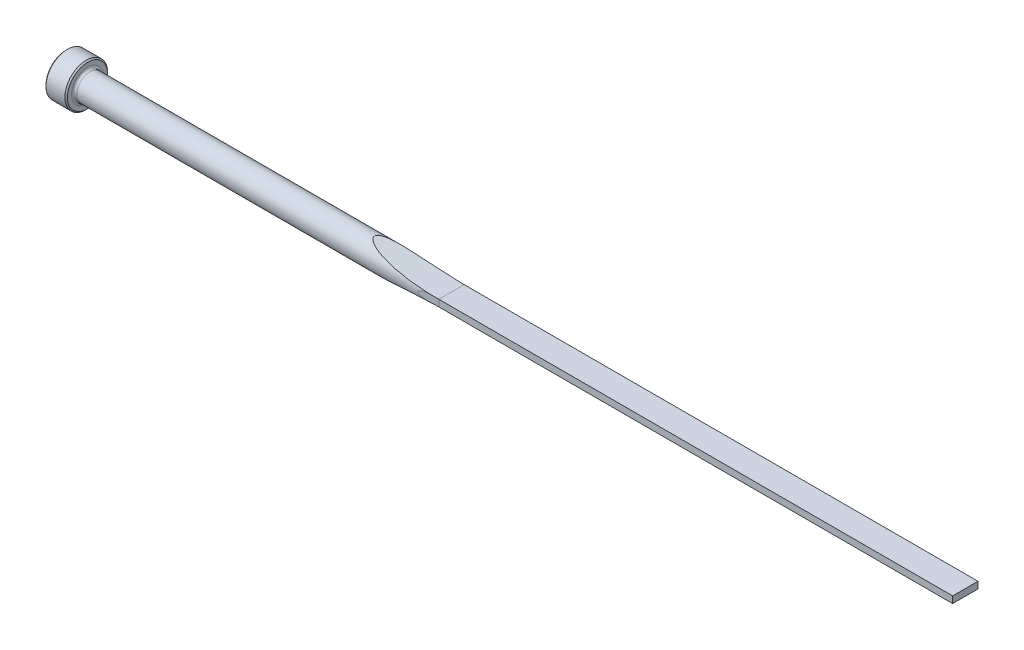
ISO-10303-21;
HEADER;
FILE_DESCRIPTION(('STEP AP214'),'2;1');
FILE_NAME('part.step','',(''),(''),'','','');
FILE_SCHEMA(('AUTOMOTIVE_DESIGN { 1 0 10303 214 1 1 1 1 }'));
ENDSEC;
DATA;
#1=APPLICATION_CONTEXT('core data for automotive mechanical design processes');
#2=APPLICATION_PROTOCOL_DEFINITION('international standard','automotive_design',2000,#1);
#3=PRODUCT_CONTEXT('',#1,'mechanical');
#4=PRODUCT('Part','Part','',(#3));
#5=PRODUCT_RELATED_PRODUCT_CATEGORY('part','',(#4));
#6=PRODUCT_DEFINITION_FORMATION('','',#4);
#7=PRODUCT_DEFINITION_CONTEXT('part definition',#1,'design');
#8=PRODUCT_DEFINITION('design','',#6,#7);
#9=PRODUCT_DEFINITION_SHAPE('','',#8);
#10=(LENGTH_UNIT() NAMED_UNIT(*) SI_UNIT(.MILLI.,.METRE.));
#11=(NAMED_UNIT(*) PLANE_ANGLE_UNIT() SI_UNIT($,.RADIAN.));
#12=(NAMED_UNIT(*) SI_UNIT($,.STERADIAN.) SOLID_ANGLE_UNIT());
#13=UNCERTAINTY_MEASURE_WITH_UNIT(LENGTH_MEASURE(1.E-05),#10,'distance_accuracy_value','');
#14=(GEOMETRIC_REPRESENTATION_CONTEXT(3) GLOBAL_UNCERTAINTY_ASSIGNED_CONTEXT((#13)) GLOBAL_UNIT_ASSIGNED_CONTEXT((#10,
#11,#12)) REPRESENTATION_CONTEXT('',''));
#15=CARTESIAN_POINT('',(0.,0.,0.));
#16=DIRECTION('',(0.,0.,1.));
#17=DIRECTION('',(1.,0.,0.));
#18=AXIS2_PLACEMENT_3D('',#15,#16,#17);
#19=CARTESIAN_POINT('',(0.,0.,0.));
#20=DIRECTION('',(-1.,0.,0.));
#21=DIRECTION('',(0.,0.,1.));
#22=AXIS2_PLACEMENT_3D('',#19,#20,#21);
#23=CYLINDRICAL_SURFACE('',#22,3.9624);
#24=CARTESIAN_POINT('',(7.112,0.,0.));
#25=DIRECTION('',(-1.,0.,0.));
#26=DIRECTION('',(0.,0.,1.));
#27=AXIS2_PLACEMENT_3D('',#24,#25,#26);
#28=CIRCLE('',#27,3.9624);
#29=CARTESIAN_POINT('',(7.112,0.,3.9624));
#30=VERTEX_POINT('',#29);
#31=EDGE_CURVE('E153',#30,#30,#28,.F.);
#32=ORIENTED_EDGE('',*,*,#31,.T.);
#33=EDGE_LOOP('',(#32));
#34=FACE_BOUND('',#33,.T.);
#35=CARTESIAN_POINT('',(114.3,1.25260892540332,3.75919999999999));
#36=CARTESIAN_POINT('',(114.00545970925,1.2524848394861,3.75919752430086));
#37=CARTESIAN_POINT('',(113.710891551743,1.24820563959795,3.76066368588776));
#38=CARTESIAN_POINT('',(113.12172376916,1.23049372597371,3.76652069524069));
#39=CARTESIAN_POINT('',(112.82712449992,1.21705045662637,3.77091491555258));
#40=CARTESIAN_POINT('',(112.230839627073,1.17967714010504,3.7827696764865));
#41=CARTESIAN_POINT('',(111.929172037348,1.15547987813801,3.79030802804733));
#42=CARTESIAN_POINT('',(111.327291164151,1.09440743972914,3.80840647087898));
#43=CARTESIAN_POINT('',(111.027077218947,1.05753871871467,3.81896502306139));
#44=CARTESIAN_POINT('',(110.580036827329,0.989457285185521,3.83693978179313));
#45=CARTESIAN_POINT('',(110.432172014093,0.964761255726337,3.84325719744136));
#46=CARTESIAN_POINT('',(110.137409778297,0.91004500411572,3.85658413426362));
#47=CARTESIAN_POINT('',(109.990512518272,0.880023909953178,3.86359376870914));
#48=CARTESIAN_POINT('',(109.69914126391,0.813153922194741,3.87821506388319));
#49=CARTESIAN_POINT('',(109.554658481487,0.776342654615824,3.88582328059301));
#50=CARTESIAN_POINT('',(109.268323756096,0.692871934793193,3.90159372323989));
#51=CARTESIAN_POINT('',(109.126472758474,0.646209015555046,3.90975614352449));
#52=CARTESIAN_POINT('',(108.918440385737,0.563595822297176,3.92220822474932));
#53=CARTESIAN_POINT('',(108.849788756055,0.533901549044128,3.92640002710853));
#54=CARTESIAN_POINT('',(108.715496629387,0.468472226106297,3.93475139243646));
#55=CARTESIAN_POINT('',(108.649847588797,0.432755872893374,3.93891101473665));
#56=CARTESIAN_POINT('',(108.560965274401,0.375177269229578,3.94463417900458));
#57=CARTESIAN_POINT('',(108.535194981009,0.357278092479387,3.94630548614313));
#58=CARTESIAN_POINT('',(108.485209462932,0.319212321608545,3.94956785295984));
#59=CARTESIAN_POINT('',(108.460999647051,0.299038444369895,3.95115862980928));
#60=CARTESIAN_POINT('',(108.414808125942,0.255565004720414,3.95421108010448));
#61=CARTESIAN_POINT('',(108.392865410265,0.23222299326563,3.9556704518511));
#62=CARTESIAN_POINT('',(108.353536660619,0.181966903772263,3.95829832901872));
#63=CARTESIAN_POINT('',(108.336121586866,0.155077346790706,3.95946868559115));
#64=CARTESIAN_POINT('',(108.315579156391,0.111677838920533,3.96085301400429));
#65=CARTESIAN_POINT('',(108.30962955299,0.0965229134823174,3.9612547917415));
#66=CARTESIAN_POINT('',(108.300234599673,0.0654488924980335,3.96188979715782));
#67=CARTESIAN_POINT('',(108.296786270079,0.0495307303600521,3.96212322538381));
#68=CARTESIAN_POINT('',(108.292762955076,0.0172237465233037,3.96239561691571));
#69=CARTESIAN_POINT('',(108.292205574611,0.00083265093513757,3.96243338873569));
#70=CARTESIAN_POINT('',(108.294083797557,-0.0317780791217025,3.9623061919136));
#71=CARTESIAN_POINT('',(108.296521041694,-0.0479976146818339,3.96214111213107));
#72=CARTESIAN_POINT('',(108.304634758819,-0.082037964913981,3.96159228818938));
#73=CARTESIAN_POINT('',(108.310722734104,-0.0997583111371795,3.96118077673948));
#74=CARTESIAN_POINT('',(108.325684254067,-0.13396962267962,3.96017177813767));
#75=CARTESIAN_POINT('',(108.334563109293,-0.15045816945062,3.959573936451));
#76=CARTESIAN_POINT('',(108.360406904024,-0.191779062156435,3.9578387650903));
#77=CARTESIAN_POINT('',(108.379002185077,-0.215572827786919,3.95659469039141));
#78=CARTESIAN_POINT('',(108.419379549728,-0.260234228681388,3.95390862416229));
#79=CARTESIAN_POINT('',(108.441170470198,-0.281093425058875,3.95246608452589));
#80=CARTESIAN_POINT('',(108.495492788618,-0.32804506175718,3.9488923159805));
#81=CARTESIAN_POINT('',(108.528933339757,-0.353067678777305,3.94670948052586));
#82=CARTESIAN_POINT('',(108.59803338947,-0.399868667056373,3.94224113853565));
#83=CARTESIAN_POINT('',(108.633697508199,-0.421639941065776,3.93995542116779));
#84=CARTESIAN_POINT('',(108.743097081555,-0.483498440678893,3.93301358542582));
#85=CARTESIAN_POINT('',(108.818906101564,-0.519877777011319,3.92829485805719));
#86=CARTESIAN_POINT('',(108.968751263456,-0.584557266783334,3.91916875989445));
#87=CARTESIAN_POINT('',(109.042649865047,-0.613195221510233,3.91475872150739));
#88=CARTESIAN_POINT('',(109.191901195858,-0.666460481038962,3.90604279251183));
#89=CARTESIAN_POINT('',(109.267254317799,-0.691086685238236,3.90173693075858));
#90=CARTESIAN_POINT('',(109.495036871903,-0.760533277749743,3.8890165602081));
#91=CARTESIAN_POINT('',(109.648854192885,-0.800789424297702,3.88081976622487));
#92=CARTESIAN_POINT('',(109.958806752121,-0.873378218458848,3.86512223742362));
#93=CARTESIAN_POINT('',(110.11494772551,-0.90568574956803,3.85762375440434));
#94=CARTESIAN_POINT('',(110.428180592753,-0.964193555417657,3.84341555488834));
#95=CARTESIAN_POINT('',(110.585270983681,-0.990401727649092,3.83670482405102));
#96=CARTESIAN_POINT('',(111.040465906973,-1.05927541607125,3.81847637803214));
#97=CARTESIAN_POINT('',(111.33953568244,-1.09580537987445,3.80800147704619));
#98=CARTESIAN_POINT('',(111.939246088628,-1.15634236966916,3.79004336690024));
#99=CARTESIAN_POINT('',(112.23988794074,-1.18033747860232,3.78256300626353));
#100=CARTESIAN_POINT('',(112.833875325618,-1.21737987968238,3.77080747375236));
#101=CARTESIAN_POINT('',(113.127202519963,-1.23070106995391,3.76645243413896));
#102=CARTESIAN_POINT('',(113.713695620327,-1.24824774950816,3.76064980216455));
#103=CARTESIAN_POINT('',(114.006861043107,-1.25248764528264,3.7591976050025));
#104=CARTESIAN_POINT('',(114.3,-1.25260892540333,3.75919999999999));
#105=B_SPLINE_CURVE_WITH_KNOTS('',3,(#35,#36,#37,#38,#39,#40,#41,#42,#43,#44,#45,#46,#47,#48,
#49,#50,#51,#52,#53,#54,#55,#56,#57,#58,#59,#60,#61,#62,#63,#64,#65,#66,#67,#68,#69,#70,#71,#72,
#73,#74,#75,#76,#77,#78,#79,#80,#81,#82,#83,#84,#85,#86,#87,#88,#89,#90,#91,#92,#93,#94,#95,#96,
#97,#98,#99,#100,#101,#102,#103,#104),.UNSPECIFIED.,.F.,.F.,(4,2,2,2,2,2,2,2,2,2,2,2,2,2,2,2,2,
2,2,2,2,2,2,2,2,2,2,2,2,2,2,2,2,2,4),(0.,0.883632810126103,1.76828515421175,2.67626818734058,
3.58378933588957,4.03386031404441,4.4840050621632,4.93172655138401,5.37960586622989,
5.60421216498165,5.82813356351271,5.92231486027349,6.01680676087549,6.11271989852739,
6.20800177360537,6.25668605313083,6.30531224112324,6.35423420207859,6.40318297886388,
6.45909548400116,6.51511503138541,6.60527273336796,6.69568462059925,6.82084462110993,
6.94627395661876,7.19837774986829,7.43639814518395,7.6744837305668,8.15173410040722,
8.63047368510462,9.10858990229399,10.0125950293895,10.9174580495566,11.7982831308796,
12.6777098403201),.UNSPECIFIED.);
#106=CARTESIAN_POINT('',(111.004990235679,1.05168448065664,3.82028448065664));
#107=VERTEX_POINT('',#106);
#108=CARTESIAN_POINT('',(111.004990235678,-1.05168448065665,3.82028448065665));
#109=VERTEX_POINT('',#108);
#110=EDGE_CURVE('E156',#107,#109,#105,.T.);
#111=ORIENTED_EDGE('',*,*,#110,.F.);
#112=CARTESIAN_POINT('',(114.3,0.990599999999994,3.83657730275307));
#113=CARTESIAN_POINT('',(113.9697161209,0.990599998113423,3.83657287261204));
#114=CARTESIAN_POINT('',(113.639435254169,0.992440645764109,3.83610266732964));
#115=CARTESIAN_POINT('',(112.978916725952,0.99980280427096,3.83419205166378));
#116=CARTESIAN_POINT('',(112.648679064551,1.0053243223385,3.83275163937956));
#117=CARTESIAN_POINT('',(111.658053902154,1.0274102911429,3.82691690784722));
#118=CARTESIAN_POINT('',(110.997788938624,1.0494961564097,3.82100908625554));
#119=CARTESIAN_POINT('',(109.676435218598,1.10844500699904,3.80432664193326));
#120=CARTESIAN_POINT('',(109.015348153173,1.14534247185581,3.79354065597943));
#121=CARTESIAN_POINT('',(107.694310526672,1.23388520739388,3.76567429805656));
#122=CARTESIAN_POINT('',(107.034359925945,1.2855299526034,3.74859415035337));
#123=CARTESIAN_POINT('',(105.715852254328,1.40353519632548,3.70602748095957));
#124=CARTESIAN_POINT('',(105.057295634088,1.46989988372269,3.68053856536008));
#125=CARTESIAN_POINT('',(103.742255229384,1.61726452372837,3.6182196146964));
#126=CARTESIAN_POINT('',(103.08577166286,1.69826596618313,3.58138842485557));
#127=CARTESIAN_POINT('',(102.103558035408,1.83058710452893,3.51453728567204));
#128=CARTESIAN_POINT('',(101.776691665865,1.87647848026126,3.49033052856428));
#129=CARTESIAN_POINT('',(101.123854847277,1.97184201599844,3.43735915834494));
#130=CARTESIAN_POINT('',(100.797884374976,2.02131408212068,3.40859466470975));
#131=CARTESIAN_POINT('',(100.147081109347,2.12378750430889,3.34570677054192));
#132=CARTESIAN_POINT('',(99.8222480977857,2.17678813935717,3.3115844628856));
#133=CARTESIAN_POINT('',(99.1739107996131,2.28626507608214,3.23697347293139));
#134=CARTESIAN_POINT('',(98.8504064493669,2.34274120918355,3.19648509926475));
#135=CARTESIAN_POINT('',(98.2047395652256,2.45913947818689,3.10783063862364));
#136=CARTESIAN_POINT('',(97.8825785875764,2.51906481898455,3.05965733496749));
#137=CARTESIAN_POINT('',(97.2403530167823,2.64218817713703,2.95398736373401));
#138=CARTESIAN_POINT('',(96.9202887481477,2.70538668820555,2.8964892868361));
#139=CARTESIAN_POINT('',(96.2828388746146,2.83488406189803,2.7698900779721));
#140=CARTESIAN_POINT('',(95.9654549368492,2.90118470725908,2.7007822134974));
#141=CARTESIAN_POINT('',(95.492569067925,3.00264596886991,2.58598405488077));
#142=CARTESIAN_POINT('',(95.3354929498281,3.03679672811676,2.54586806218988));
#143=CARTESIAN_POINT('',(95.0226368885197,3.10569973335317,2.46134595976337));
#144=CARTESIAN_POINT('',(94.866856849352,3.14045193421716,2.41694017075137));
#145=CARTESIAN_POINT('',(94.5564212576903,3.21057634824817,2.32298544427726));
#146=CARTESIAN_POINT('',(94.4017708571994,3.24595018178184,2.27342059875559));
#147=CARTESIAN_POINT('',(94.0945437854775,3.31707981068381,2.16832369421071));
#148=CARTESIAN_POINT('',(93.9419675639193,3.35283568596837,2.11279036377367));
#149=CARTESIAN_POINT('',(93.6400973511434,3.4244077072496,1.99469390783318));
#150=CARTESIAN_POINT('',(93.4907949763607,3.46022336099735,1.93215209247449));
#151=CARTESIAN_POINT('',(93.1962051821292,3.53168170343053,1.79822571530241));
#152=CARTESIAN_POINT('',(93.050915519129,3.56732447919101,1.7268462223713));
#153=CARTESIAN_POINT('',(92.7936363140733,3.63110569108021,1.58756568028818));
#154=CARTESIAN_POINT('',(92.6806184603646,3.65936845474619,1.52163804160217));
#155=CARTESIAN_POINT('',(92.4598827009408,3.71501044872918,1.38025632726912));
#156=CARTESIAN_POINT('',(92.3521804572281,3.74238699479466,1.30477619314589));
#157=CARTESIAN_POINT('',(92.1442872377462,3.79561737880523,1.1408213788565));
#158=CARTESIAN_POINT('',(92.0442076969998,3.82144775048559,1.05219528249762));
#159=CARTESIAN_POINT('',(91.8595768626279,3.86940293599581,0.859157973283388));
#160=CARTESIAN_POINT('',(91.7749415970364,3.89154772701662,0.754838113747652));
#161=CARTESIAN_POINT('',(91.6699193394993,3.91914686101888,0.586474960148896));
#162=CARTESIAN_POINT('',(91.6389545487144,3.92730670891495,0.529540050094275));
#163=CARTESIAN_POINT('',(91.585487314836,3.94141927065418,0.411526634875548));
#164=CARTESIAN_POINT('',(91.5629775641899,3.94737389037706,0.350451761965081));
#165=CARTESIAN_POINT('',(91.5283368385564,3.95654565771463,0.224449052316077));
#166=CARTESIAN_POINT('',(91.516316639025,3.95973358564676,0.159487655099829));
#167=CARTESIAN_POINT('',(91.5046069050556,3.96283907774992,0.0283885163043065));
#168=CARTESIAN_POINT('',(91.5049079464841,3.96275914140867,-0.0377482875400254));
#169=CARTESIAN_POINT('',(91.5170523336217,3.9595385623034,-0.161504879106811));
#170=CARTESIAN_POINT('',(91.5276298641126,3.95673358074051,-0.219265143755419));
#171=CARTESIAN_POINT('',(91.557415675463,3.94884592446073,-0.332339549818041));
#172=CARTESIAN_POINT('',(91.5766306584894,3.94376148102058,-0.387651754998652));
#173=CARTESIAN_POINT('',(91.6328391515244,3.92891668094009,-0.520111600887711));
#174=CARTESIAN_POINT('',(91.6739445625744,3.91808157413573,-0.595377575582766));
#175=CARTESIAN_POINT('',(91.7669212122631,3.89366591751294,-0.738435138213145));
#176=CARTESIAN_POINT('',(91.8188218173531,3.88007788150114,-0.806205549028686));
#177=CARTESIAN_POINT('',(91.9247534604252,3.85246275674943,-0.928819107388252));
#178=CARTESIAN_POINT('',(91.9781271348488,3.83859662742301,-0.984278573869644));
#179=CARTESIAN_POINT('',(92.0893027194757,3.80983427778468,-1.09032012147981));
#180=CARTESIAN_POINT('',(92.1471085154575,3.79493715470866,-1.14089783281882));
#181=CARTESIAN_POINT('',(92.266095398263,3.76440868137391,-1.23791396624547));
#182=CARTESIAN_POINT('',(92.3272835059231,3.74877581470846,-1.28434321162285));
#183=CARTESIAN_POINT('',(92.4521157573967,3.71703035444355,-1.37351180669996));
#184=CARTESIAN_POINT('',(92.5157589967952,3.70091793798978,-1.41625249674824));
#185=CARTESIAN_POINT('',(92.6792221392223,3.65973348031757,-1.52038239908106));
#186=CARTESIAN_POINT('',(92.7803365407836,3.63443926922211,-1.57964797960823));
#187=CARTESIAN_POINT('',(92.9857900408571,3.58344108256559,-1.69214942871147));
#188=CARTESIAN_POINT('',(93.0901308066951,3.55773689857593,-1.74538211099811));
#189=CARTESIAN_POINT('',(93.3013643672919,3.50611562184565,-1.84689329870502));
#190=CARTESIAN_POINT('',(93.4082612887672,3.48019823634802,-1.89516301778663));
#191=CARTESIAN_POINT('',(93.6238923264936,3.42834878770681,-1.98741770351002));
#192=CARTESIAN_POINT('',(93.7326267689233,3.40241672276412,-2.03140189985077));
#193=CARTESIAN_POINT('',(94.0621134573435,3.32450390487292,-2.15829335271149));
#194=CARTESIAN_POINT('',(94.2850557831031,3.27267410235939,-2.23563168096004));
#195=CARTESIAN_POINT('',(94.6221345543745,3.19570441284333,-2.34307368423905));
#196=CARTESIAN_POINT('',(94.7348766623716,3.1701906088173,-2.37744382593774));
#197=CARTESIAN_POINT('',(94.9611693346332,3.11944659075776,-2.44364722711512));
#198=CARTESIAN_POINT('',(95.0747198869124,3.09421637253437,-2.47548052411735));
#199=CARTESIAN_POINT('',(95.4104539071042,3.02031374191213,-2.56598748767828));
#200=CARTESIAN_POINT('',(95.6335886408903,2.97208906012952,-2.62150201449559));
#201=CARTESIAN_POINT('',(96.0818053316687,2.87703845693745,-2.72547491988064));
#202=CARTESIAN_POINT('',(96.3068875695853,2.83021274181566,-2.77393226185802));
#203=CARTESIAN_POINT('',(96.7586626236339,2.73806329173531,-2.86492906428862));
#204=CARTESIAN_POINT('',(96.9853561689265,2.69274029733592,-2.90746563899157));
#205=CARTESIAN_POINT('',(97.4399562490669,2.60370183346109,-2.9874606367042));
#206=CARTESIAN_POINT('',(97.6678628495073,2.55998645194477,-3.02491878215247));
#207=CARTESIAN_POINT('',(98.3540991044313,2.43115134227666,-3.13090570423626));
#208=CARTESIAN_POINT('',(98.8139246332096,2.34855100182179,-3.19284857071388));
#209=CARTESIAN_POINT('',(99.7362107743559,2.19040055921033,-3.30333290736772));
#210=CARTESIAN_POINT('',(100.198670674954,2.11484864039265,-3.35187783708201));
#211=CARTESIAN_POINT('',(101.126223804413,1.97085164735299,-3.43852039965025));
#212=CARTESIAN_POINT('',(101.591319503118,1.90241509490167,-3.47660559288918));
#213=CARTESIAN_POINT('',(102.523152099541,1.77285400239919,-3.54442368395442));
#214=CARTESIAN_POINT('',(102.989889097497,1.71172991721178,-3.57415606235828));
#215=CARTESIAN_POINT('',(103.924078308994,1.59693400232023,-3.62689928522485));
#216=CARTESIAN_POINT('',(104.391528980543,1.54325327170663,-3.64991819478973));
#217=CARTESIAN_POINT('',(105.3274350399,1.44330178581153,-3.69058205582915));
#218=CARTESIAN_POINT('',(105.79589039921,1.39703082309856,-3.70822715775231));
#219=CARTESIAN_POINT('',(106.934572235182,1.29368812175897,-3.74582413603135));
#220=CARTESIAN_POINT('',(107.605227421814,1.24048648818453,-3.76352357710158));
#221=CARTESIAN_POINT('',(108.947882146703,1.14930326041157,-3.79235889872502));
#222=CARTESIAN_POINT('',(109.619882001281,1.1113258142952,-3.80349299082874));
#223=CARTESIAN_POINT('',(110.959832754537,1.05085761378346,-3.82064091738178));
#224=CARTESIAN_POINT('',(111.627778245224,1.02825806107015,-3.82669079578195));
#225=CARTESIAN_POINT('',(112.629852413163,1.00566200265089,-3.83266331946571));
#226=CARTESIAN_POINT('',(112.963854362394,1.00001386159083,-3.83413712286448));
#227=CARTESIAN_POINT('',(113.631903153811,0.992482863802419,-3.83609180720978));
#228=CARTESIAN_POINT('',(113.965949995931,0.990600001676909,-3.83657268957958));
#229=CARTESIAN_POINT('',(114.3,0.990599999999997,-3.83657730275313));
#230=B_SPLINE_CURVE_WITH_KNOTS('',3,(#112,#113,#114,#115,#116,#117,#118,#119,#120,#121,#122,
#123,#124,#125,#126,#127,#128,#129,#130,#131,#132,#133,#134,#135,#136,#137,#138,#139,#140,#141,
#142,#143,#144,#145,#146,#147,#148,#149,#150,#151,#152,#153,#154,#155,#156,#157,#158,#159,#160,
#161,#162,#163,#164,#165,#166,#167,#168,#169,#170,#171,#172,#173,#174,#175,#176,#177,#178,#179,
#180,#181,#182,#183,#184,#185,#186,#187,#188,#189,#190,#191,#192,#193,#194,#195,#196,#197,#198,
#199,#200,#201,#202,#203,#204,#205,#206,#207,#208,#209,#210,#211,#212,#213,#214,#215,#216,#217,
#218,#219,#220,#221,#222,#223,#224,#225,#226,#227,#228,#229),.UNSPECIFIED.,.F.,.F.,(4,2,2,2,2,2,
2,2,2,2,2,2,2,2,2,2,2,2,2,2,2,2,2,2,2,2,2,2,2,2,2,2,2,2,2,2,2,2,2,2,2,2,2,2,2,2,2,2,2,2,2,2,2,2,
2,2,2,2,4),(0.,0.990840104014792,1.98168214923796,3.9634703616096,5.94989893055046,
7.93625672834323,9.92318051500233,11.9103066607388,12.9031409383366,13.8959491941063,
14.8885552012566,15.8811131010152,16.8746086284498,17.8682544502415,18.86247848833,
19.3594573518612,19.8563990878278,20.3549212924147,20.853549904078,21.3507015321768,
21.8475693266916,22.2488324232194,22.6512147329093,23.0586550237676,23.4638093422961,
23.6592125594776,23.8544465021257,24.0517181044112,24.2488388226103,24.4244032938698,
24.6001042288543,24.8579506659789,25.1165079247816,25.3507932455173,25.5852863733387,
25.8202859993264,26.0551998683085,26.4146312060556,26.7742515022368,27.1344978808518,
27.4948088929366,28.2191273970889,28.5808955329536,28.9426583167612,29.6473193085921,
30.3520836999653,31.0571903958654,31.7623356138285,33.175804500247,34.5889080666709,
36.0036850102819,37.418549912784,38.8317080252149,40.2448265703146,42.2635801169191,
44.282883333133,46.287747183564,47.2898866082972,48.2920245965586),.UNSPECIFIED.);
#231=CARTESIAN_POINT('',(111.004990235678,1.05168448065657,-3.82028448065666));
#232=VERTEX_POINT('',#231);
#233=EDGE_CURVE('E106',#107,#232,#230,.T.);
#234=ORIENTED_EDGE('',*,*,#233,.T.);
#235=CARTESIAN_POINT('',(114.3,1.25260892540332,-3.75919999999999));
#236=CARTESIAN_POINT('',(114.00545970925,1.2524848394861,-3.75919752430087));
#237=CARTESIAN_POINT('',(113.710891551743,1.24820563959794,-3.76066368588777));
#238=CARTESIAN_POINT('',(113.12172376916,1.23049372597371,-3.76652069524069));
#239=CARTESIAN_POINT('',(112.827124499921,1.21705045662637,-3.77091491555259));
#240=CARTESIAN_POINT('',(112.230839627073,1.17967714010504,-3.78276967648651));
#241=CARTESIAN_POINT('',(111.929172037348,1.15547987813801,-3.79030802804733));
#242=CARTESIAN_POINT('',(111.327291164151,1.09440743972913,-3.80840647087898));
#243=CARTESIAN_POINT('',(111.027077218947,1.05753871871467,-3.81896502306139));
#244=CARTESIAN_POINT('',(110.580036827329,0.98945728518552,-3.83693978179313));
#245=CARTESIAN_POINT('',(110.432172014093,0.964761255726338,-3.84325719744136));
#246=CARTESIAN_POINT('',(110.137409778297,0.910045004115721,-3.85658413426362));
#247=CARTESIAN_POINT('',(109.990512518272,0.880023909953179,-3.86359376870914));
#248=CARTESIAN_POINT('',(109.69914126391,0.813153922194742,-3.87821506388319));
#249=CARTESIAN_POINT('',(109.554658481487,0.776342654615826,-3.88582328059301));
#250=CARTESIAN_POINT('',(109.268323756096,0.692871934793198,-3.90159372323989));
#251=CARTESIAN_POINT('',(109.126472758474,0.646209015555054,-3.90975614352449));
#252=CARTESIAN_POINT('',(108.918440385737,0.56359582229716,-3.92220822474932));
#253=CARTESIAN_POINT('',(108.849788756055,0.533901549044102,-3.92640002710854));
#254=CARTESIAN_POINT('',(108.715496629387,0.468472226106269,-3.93475139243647));
#255=CARTESIAN_POINT('',(108.649847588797,0.432755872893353,-3.93891101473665));
#256=CARTESIAN_POINT('',(108.560965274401,0.37517726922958,-3.94463417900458));
#257=CARTESIAN_POINT('',(108.535194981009,0.357278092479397,-3.94630548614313));
#258=CARTESIAN_POINT('',(108.485209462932,0.319212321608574,-3.94956785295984));
#259=CARTESIAN_POINT('',(108.460999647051,0.299038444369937,-3.95115862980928));
#260=CARTESIAN_POINT('',(108.414808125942,0.25556500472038,-3.95421108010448));
#261=CARTESIAN_POINT('',(108.392865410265,0.232222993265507,-3.95567045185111));
#262=CARTESIAN_POINT('',(108.353536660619,0.181966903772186,-3.95829832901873));
#263=CARTESIAN_POINT('',(108.336121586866,0.15507734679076,-3.95946868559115));
#264=CARTESIAN_POINT('',(108.315579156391,0.111677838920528,-3.96085301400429));
#265=CARTESIAN_POINT('',(108.30962955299,0.0965229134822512,-3.9612547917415));
#266=CARTESIAN_POINT('',(108.300234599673,0.0654488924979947,-3.96188979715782));
#267=CARTESIAN_POINT('',(108.296786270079,0.0495307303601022,-3.96212322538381));
#268=CARTESIAN_POINT('',(108.292762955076,0.0172237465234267,-3.9623956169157));
#269=CARTESIAN_POINT('',(108.292205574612,0.000832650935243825,-3.96243338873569));
#270=CARTESIAN_POINT('',(108.294083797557,-0.0317780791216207,-3.9623061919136));
#271=CARTESIAN_POINT('',(108.296521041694,-0.0479976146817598,-3.96214111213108));
#272=CARTESIAN_POINT('',(108.304634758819,-0.0820379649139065,-3.96159228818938));
#273=CARTESIAN_POINT('',(108.310722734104,-0.0997583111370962,-3.96118077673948));
#274=CARTESIAN_POINT('',(108.325684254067,-0.133969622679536,-3.96017177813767));
#275=CARTESIAN_POINT('',(108.334563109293,-0.150458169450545,-3.959573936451));
#276=CARTESIAN_POINT('',(108.360406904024,-0.191779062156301,-3.9578387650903));
#277=CARTESIAN_POINT('',(108.379002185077,-0.215572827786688,-3.95659469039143));
#278=CARTESIAN_POINT('',(108.419379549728,-0.260234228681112,-3.9539086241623));
#279=CARTESIAN_POINT('',(108.441170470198,-0.281093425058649,-3.9524660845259));
#280=CARTESIAN_POINT('',(108.495492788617,-0.328045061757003,-3.94889231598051));
#281=CARTESIAN_POINT('',(108.528933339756,-0.353067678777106,-3.94670948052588));
#282=CARTESIAN_POINT('',(108.59803338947,-0.399868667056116,-3.94224113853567));
#283=CARTESIAN_POINT('',(108.633697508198,-0.421639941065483,-3.93995542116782));
#284=CARTESIAN_POINT('',(108.743097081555,-0.483498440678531,-3.93301358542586));
#285=CARTESIAN_POINT('',(108.818906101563,-0.519877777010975,-3.92829485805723));
#286=CARTESIAN_POINT('',(108.968751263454,-0.584557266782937,-3.91916875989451));
#287=CARTESIAN_POINT('',(109.042649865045,-0.613195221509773,-3.91475872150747));
#288=CARTESIAN_POINT('',(109.191901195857,-0.666460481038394,-3.90604279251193));
#289=CARTESIAN_POINT('',(109.267254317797,-0.691086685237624,-3.90173693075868));
#290=CARTESIAN_POINT('',(109.495036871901,-0.760533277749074,-3.88901656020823));
#291=CARTESIAN_POINT('',(109.648854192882,-0.800789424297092,-3.88081976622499));
#292=CARTESIAN_POINT('',(109.958806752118,-0.873378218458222,-3.86512223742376));
#293=CARTESIAN_POINT('',(110.114947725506,-0.905685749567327,-3.8576237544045));
#294=CARTESIAN_POINT('',(110.42818059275,-0.964193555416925,-3.84341555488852));
#295=CARTESIAN_POINT('',(110.585270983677,-0.990401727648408,-3.8367048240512));
#296=CARTESIAN_POINT('',(111.040465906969,-1.05927541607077,-3.81847637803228));
#297=CARTESIAN_POINT('',(111.339535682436,-1.09580537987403,-3.80800147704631));
#298=CARTESIAN_POINT('',(111.939246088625,-1.1563423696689,-3.79004336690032));
#299=CARTESIAN_POINT('',(112.239887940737,-1.18033747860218,-3.78256300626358));
#300=CARTESIAN_POINT('',(112.833875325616,-1.21737987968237,-3.77080747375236));
#301=CARTESIAN_POINT('',(113.127202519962,-1.23070106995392,-3.76645243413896));
#302=CARTESIAN_POINT('',(113.713695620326,-1.24824774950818,-3.76064980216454));
#303=CARTESIAN_POINT('',(114.006861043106,-1.25248764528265,-3.7591976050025));
#304=CARTESIAN_POINT('',(114.3,-1.25260892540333,-3.75919999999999));
#305=B_SPLINE_CURVE_WITH_KNOTS('',3,(#235,#236,#237,#238,#239,#240,#241,#242,#243,#244,#245,
#246,#247,#248,#249,#250,#251,#252,#253,#254,#255,#256,#257,#258,#259,#260,#261,#262,#263,#264,
#265,#266,#267,#268,#269,#270,#271,#272,#273,#274,#275,#276,#277,#278,#279,#280,#281,#282,#283,
#284,#285,#286,#287,#288,#289,#290,#291,#292,#293,#294,#295,#296,#297,#298,#299,#300,#301,#302,
#303,#304),.UNSPECIFIED.,.F.,.F.,(4,2,2,2,2,2,2,2,2,2,2,2,2,2,2,2,2,2,2,2,2,2,2,2,2,2,2,2,2,2,2,
2,2,2,4),(0.,0.883632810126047,1.76828515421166,2.67626818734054,3.58378933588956,
4.03386031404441,4.48400506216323,4.93172655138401,5.37960586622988,5.60421216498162,
5.82813356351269,5.92231486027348,6.01680676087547,6.11271989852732,6.20800177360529,
6.25668605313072,6.30531224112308,6.35423420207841,6.40318297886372,6.459095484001,
6.51511503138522,6.60527273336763,6.69568462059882,6.82084462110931,6.94627395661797,
7.1983777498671,7.4363981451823,7.6744837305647,8.15173410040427,8.63047368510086,
9.10858990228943,10.0125950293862,10.9174580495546,11.7982831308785,12.67770984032),.UNSPECIFIED.);
#306=CARTESIAN_POINT('',(111.004990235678,-1.05168448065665,-3.82028448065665));
#307=VERTEX_POINT('',#306);
#308=EDGE_CURVE('E175',#232,#307,#305,.T.);
#309=ORIENTED_EDGE('',*,*,#308,.T.);
#310=CARTESIAN_POINT('',(114.3,-0.990599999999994,3.83657730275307));
#311=CARTESIAN_POINT('',(113.9697161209,-0.990599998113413,3.83657287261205));
#312=CARTESIAN_POINT('',(113.639435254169,-0.992440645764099,3.83610266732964));
#313=CARTESIAN_POINT('',(112.978916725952,-0.999802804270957,3.83419205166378));
#314=CARTESIAN_POINT('',(112.648679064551,-1.0053243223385,3.83275163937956));
#315=CARTESIAN_POINT('',(111.658053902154,-1.0274102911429,3.82691690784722));
#316=CARTESIAN_POINT('',(110.997788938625,-1.0494961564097,3.82100908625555));
#317=CARTESIAN_POINT('',(109.676435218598,-1.10844500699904,3.80432664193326));
#318=CARTESIAN_POINT('',(109.015348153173,-1.14534247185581,3.79354065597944));
#319=CARTESIAN_POINT('',(107.694310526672,-1.23388520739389,3.76567429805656));
#320=CARTESIAN_POINT('',(107.034359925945,-1.28552995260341,3.74859415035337));
#321=CARTESIAN_POINT('',(105.715852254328,-1.40353519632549,3.70602748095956));
#322=CARTESIAN_POINT('',(105.057295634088,-1.4698998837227,3.68053856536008));
#323=CARTESIAN_POINT('',(103.742255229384,-1.61726452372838,3.6182196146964));
#324=CARTESIAN_POINT('',(103.08577166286,-1.69826596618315,3.58138842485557));
#325=CARTESIAN_POINT('',(102.103558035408,-1.83058710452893,3.51453728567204));
#326=CARTESIAN_POINT('',(101.776691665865,-1.87647848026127,3.49033052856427));
#327=CARTESIAN_POINT('',(101.123854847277,-1.97184201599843,3.43735915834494));
#328=CARTESIAN_POINT('',(100.797884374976,-2.02131408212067,3.40859466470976));
#329=CARTESIAN_POINT('',(100.147081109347,-2.12378750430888,3.34570677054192));
#330=CARTESIAN_POINT('',(99.8222480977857,-2.17678813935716,3.3115844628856));
#331=CARTESIAN_POINT('',(99.1739107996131,-2.28626507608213,3.23697347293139));
#332=CARTESIAN_POINT('',(98.8504064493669,-2.34274120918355,3.19648509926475));
#333=CARTESIAN_POINT('',(98.2047395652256,-2.45913947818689,3.10783063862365));
#334=CARTESIAN_POINT('',(97.8825785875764,-2.51906481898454,3.05965733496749));
#335=CARTESIAN_POINT('',(97.2403530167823,-2.64218817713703,2.95398736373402));
#336=CARTESIAN_POINT('',(96.9202887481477,-2.70538668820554,2.89648928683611));
#337=CARTESIAN_POINT('',(96.2828388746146,-2.83488406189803,2.7698900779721));
#338=CARTESIAN_POINT('',(95.9654549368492,-2.90118470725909,2.7007822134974));
#339=CARTESIAN_POINT('',(95.492569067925,-3.0026459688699,2.58598405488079));
#340=CARTESIAN_POINT('',(95.3354929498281,-3.03679672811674,2.54586806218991));
#341=CARTESIAN_POINT('',(95.0226368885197,-3.10569973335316,2.46134595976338));
#342=CARTESIAN_POINT('',(94.866856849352,-3.14045193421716,2.41694017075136));
#343=CARTESIAN_POINT('',(94.5564212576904,-3.21057634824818,2.32298544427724));
#344=CARTESIAN_POINT('',(94.4017708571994,-3.24595018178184,2.27342059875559));
#345=CARTESIAN_POINT('',(94.0945437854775,-3.3170798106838,2.16832369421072));
#346=CARTESIAN_POINT('',(93.9419675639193,-3.35283568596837,2.11279036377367));
#347=CARTESIAN_POINT('',(93.6400973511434,-3.4244077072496,1.99469390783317));
#348=CARTESIAN_POINT('',(93.4907949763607,-3.46022336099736,1.93215209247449));
#349=CARTESIAN_POINT('',(93.1962051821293,-3.53168170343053,1.79822571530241));
#350=CARTESIAN_POINT('',(93.050915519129,-3.56732447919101,1.7268462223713));
#351=CARTESIAN_POINT('',(92.7936363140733,-3.6311056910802,1.58756568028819));
#352=CARTESIAN_POINT('',(92.6806184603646,-3.65936845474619,1.52163804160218));
#353=CARTESIAN_POINT('',(92.4598827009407,-3.71501044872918,1.38025632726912));
#354=CARTESIAN_POINT('',(92.3521804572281,-3.74238699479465,1.30477619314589));
#355=CARTESIAN_POINT('',(92.1442872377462,-3.79561737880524,1.1408213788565));
#356=CARTESIAN_POINT('',(92.0442076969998,-3.82144775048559,1.05219528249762));
#357=CARTESIAN_POINT('',(91.8595768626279,-3.86940293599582,0.859157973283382));
#358=CARTESIAN_POINT('',(91.7749415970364,-3.89154772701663,0.754838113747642));
#359=CARTESIAN_POINT('',(91.6699193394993,-3.91914686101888,0.586474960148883));
#360=CARTESIAN_POINT('',(91.6389545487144,-3.92730670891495,0.529540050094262));
#361=CARTESIAN_POINT('',(91.585487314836,-3.94141927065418,0.411526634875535));
#362=CARTESIAN_POINT('',(91.5629775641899,-3.94737389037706,0.350451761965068));
#363=CARTESIAN_POINT('',(91.5283368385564,-3.95654565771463,0.224449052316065));
#364=CARTESIAN_POINT('',(91.516316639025,-3.95973358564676,0.159487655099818));
#365=CARTESIAN_POINT('',(91.5046069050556,-3.96283907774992,0.0283885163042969));
#366=CARTESIAN_POINT('',(91.5049079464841,-3.96275914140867,-0.0377482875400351));
#367=CARTESIAN_POINT('',(91.5170523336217,-3.9595385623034,-0.16150487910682));
#368=CARTESIAN_POINT('',(91.5276298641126,-3.95673358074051,-0.219265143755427));
#369=CARTESIAN_POINT('',(91.557415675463,-3.94884592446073,-0.33233954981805));
#370=CARTESIAN_POINT('',(91.5766306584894,-3.94376148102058,-0.387651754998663));
#371=CARTESIAN_POINT('',(91.6328391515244,-3.92891668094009,-0.520111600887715));
#372=CARTESIAN_POINT('',(91.6739445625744,-3.91808157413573,-0.595377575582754));
#373=CARTESIAN_POINT('',(91.7669212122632,-3.89366591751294,-0.73843513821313));
#374=CARTESIAN_POINT('',(91.8188218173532,-3.88007788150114,-0.806205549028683));
#375=CARTESIAN_POINT('',(91.9247534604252,-3.85246275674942,-0.928819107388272));
#376=CARTESIAN_POINT('',(91.9781271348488,-3.838596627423,-0.984278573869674));
#377=CARTESIAN_POINT('',(92.0893027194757,-3.80983427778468,-1.09032012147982));
#378=CARTESIAN_POINT('',(92.1471085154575,-3.79493715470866,-1.14089783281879));
#379=CARTESIAN_POINT('',(92.266095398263,-3.76440868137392,-1.23791396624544));
#380=CARTESIAN_POINT('',(92.3272835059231,-3.74877581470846,-1.28434321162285));
#381=CARTESIAN_POINT('',(92.4521157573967,-3.71703035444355,-1.37351180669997));
#382=CARTESIAN_POINT('',(92.5157589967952,-3.70091793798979,-1.41625249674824));
#383=CARTESIAN_POINT('',(92.6792221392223,-3.65973348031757,-1.52038239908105));
#384=CARTESIAN_POINT('',(92.7803365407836,-3.6344392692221,-1.57964797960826));
#385=CARTESIAN_POINT('',(92.9857900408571,-3.58344108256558,-1.6921494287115));
#386=CARTESIAN_POINT('',(93.0901308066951,-3.55773689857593,-1.74538211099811));
#387=CARTESIAN_POINT('',(93.3013643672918,-3.50611562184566,-1.84689329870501));
#388=CARTESIAN_POINT('',(93.4082612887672,-3.48019823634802,-1.89516301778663));
#389=CARTESIAN_POINT('',(93.6238923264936,-3.4283487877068,-1.98741770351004));
#390=CARTESIAN_POINT('',(93.7326267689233,-3.40241672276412,-2.03140189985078));
#391=CARTESIAN_POINT('',(94.0621134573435,-3.32450390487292,-2.15829335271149));
#392=CARTESIAN_POINT('',(94.285055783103,-3.27267410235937,-2.23563168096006));
#393=CARTESIAN_POINT('',(94.6221345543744,-3.19570441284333,-2.34307368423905));
#394=CARTESIAN_POINT('',(94.7348766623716,-3.17019060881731,-2.37744382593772));
#395=CARTESIAN_POINT('',(94.9611693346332,-3.11944659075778,-2.4436472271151));
#396=CARTESIAN_POINT('',(95.0747198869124,-3.09421637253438,-2.47548052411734));
#397=CARTESIAN_POINT('',(95.4104539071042,-3.02031374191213,-2.56598748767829));
#398=CARTESIAN_POINT('',(95.6335886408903,-2.97208906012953,-2.62150201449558));
#399=CARTESIAN_POINT('',(96.0818053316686,-2.87703845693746,-2.72547491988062));
#400=CARTESIAN_POINT('',(96.3068875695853,-2.83021274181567,-2.77393226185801));
#401=CARTESIAN_POINT('',(96.7586626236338,-2.73806329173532,-2.86492906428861));
#402=CARTESIAN_POINT('',(96.9853561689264,-2.69274029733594,-2.90746563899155));
#403=CARTESIAN_POINT('',(97.4399562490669,-2.60370183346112,-2.98746063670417));
#404=CARTESIAN_POINT('',(97.6678628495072,-2.55998645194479,-3.02491878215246));
#405=CARTESIAN_POINT('',(98.3540991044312,-2.43115134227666,-3.13090570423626));
#406=CARTESIAN_POINT('',(98.8139246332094,-2.34855100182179,-3.19284857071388));
#407=CARTESIAN_POINT('',(99.7362107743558,-2.19040055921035,-3.30333290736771));
#408=CARTESIAN_POINT('',(100.198670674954,-2.11484864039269,-3.35187783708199));
#409=CARTESIAN_POINT('',(101.126223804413,-1.97085164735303,-3.43852039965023));
#410=CARTESIAN_POINT('',(101.591319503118,-1.90241509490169,-3.47660559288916));
#411=CARTESIAN_POINT('',(102.523152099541,-1.77285400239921,-3.54442368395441));
#412=CARTESIAN_POINT('',(102.989889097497,-1.71172991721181,-3.57415606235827));
#413=CARTESIAN_POINT('',(103.924078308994,-1.59693400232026,-3.62689928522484));
#414=CARTESIAN_POINT('',(104.391528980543,-1.54325327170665,-3.64991819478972));
#415=CARTESIAN_POINT('',(105.3274350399,-1.44330178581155,-3.69058205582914));
#416=CARTESIAN_POINT('',(105.79589039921,-1.39703082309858,-3.7082271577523));
#417=CARTESIAN_POINT('',(106.934572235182,-1.29368812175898,-3.74582413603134));
#418=CARTESIAN_POINT('',(107.605227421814,-1.24048648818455,-3.76352357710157));
#419=CARTESIAN_POINT('',(108.947882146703,-1.14930326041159,-3.79235889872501));
#420=CARTESIAN_POINT('',(109.619882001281,-1.11132581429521,-3.80349299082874));
#421=CARTESIAN_POINT('',(110.959832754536,-1.05085761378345,-3.82064091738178));
#422=CARTESIAN_POINT('',(111.627778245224,-1.02825806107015,-3.82669079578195));
#423=CARTESIAN_POINT('',(112.629852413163,-1.0056620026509,-3.83266331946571));
#424=CARTESIAN_POINT('',(112.963854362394,-1.00001386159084,-3.83413712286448));
#425=CARTESIAN_POINT('',(113.631903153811,-0.992482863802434,-3.83609180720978));
#426=CARTESIAN_POINT('',(113.965949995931,-0.99060000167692,-3.83657268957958));
#427=CARTESIAN_POINT('',(114.3,-0.990599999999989,-3.83657730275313));
#428=B_SPLINE_CURVE_WITH_KNOTS('',3,(#310,#311,#312,#313,#314,#315,#316,#317,#318,#319,#320,
#321,#322,#323,#324,#325,#326,#327,#328,#329,#330,#331,#332,#333,#334,#335,#336,#337,#338,#339,
#340,#341,#342,#343,#344,#345,#346,#347,#348,#349,#350,#351,#352,#353,#354,#355,#356,#357,#358,
#359,#360,#361,#362,#363,#364,#365,#366,#367,#368,#369,#370,#371,#372,#373,#374,#375,#376,#377,
#378,#379,#380,#381,#382,#383,#384,#385,#386,#387,#388,#389,#390,#391,#392,#393,#394,#395,#396,
#397,#398,#399,#400,#401,#402,#403,#404,#405,#406,#407,#408,#409,#410,#411,#412,#413,#414,#415,
#416,#417,#418,#419,#420,#421,#422,#423,#424,#425,#426,#427),.UNSPECIFIED.,.F.,.F.,(4,2,2,2,2,2,
2,2,2,2,2,2,2,2,2,2,2,2,2,2,2,2,2,2,2,2,2,2,2,2,2,2,2,2,2,2,2,2,2,2,2,2,2,2,2,2,2,2,2,2,2,2,2,2,
2,2,2,2,4),(0.,0.990840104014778,1.98168214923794,3.96347036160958,5.94989893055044,
7.93625672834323,9.92318051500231,11.9103066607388,12.9031409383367,13.8959491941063,
14.8885552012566,15.8811131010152,16.8746086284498,17.8682544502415,18.86247848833,
19.3594573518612,19.8563990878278,20.3549212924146,20.853549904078,21.3507015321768,
21.8475693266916,22.2488324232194,22.6512147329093,23.0586550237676,23.4638093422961,
23.6592125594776,23.8544465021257,24.0517181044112,24.2488388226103,24.4244032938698,
24.6001042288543,24.8579506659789,25.1165079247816,25.3507932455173,25.5852863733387,
25.8202859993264,26.0551998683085,26.4146312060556,26.7742515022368,27.1344978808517,
27.4948088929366,28.2191273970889,28.5808955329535,28.9426583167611,29.647319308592,
30.3520836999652,31.0571903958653,31.7623356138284,33.1758045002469,34.5889080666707,
36.0036850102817,37.4185499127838,38.8317080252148,40.2448265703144,42.2635801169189,
44.2828833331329,46.287747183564,47.2898866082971,48.2920245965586),.UNSPECIFIED.);
#429=EDGE_CURVE('E105',#109,#307,#428,.T.);
#430=ORIENTED_EDGE('',*,*,#429,.F.);
#431=EDGE_LOOP('',(#111,#234,#309,#430));
#432=FACE_BOUND('',#431,.T.);
#433=ADVANCED_FACE('F33',(#34,#432),#23,.T.);
#434=CARTESIAN_POINT('',(266.7,3.9624,0.));
#435=DIRECTION('',(-1.,0.,0.));
#436=DIRECTION('',(0.,0.,1.));
#437=AXIS2_PLACEMENT_3D('',#434,#435,#436);
#438=PLANE('',#437);
#439=DIRECTION('',(0.,1.,0.));
#440=VECTOR('',#439,1.);
#441=CARTESIAN_POINT('',(266.7,-6.35,3.75920000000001));
#442=LINE('',#441,#440);
#443=CARTESIAN_POINT('',(266.7,-0.990600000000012,3.75920000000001));
#444=VERTEX_POINT('',#443);
#445=CARTESIAN_POINT('',(266.7,0.990600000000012,3.75920000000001));
#446=VERTEX_POINT('',#445);
#447=EDGE_CURVE('E87',#444,#446,#442,.T.);
#448=ORIENTED_EDGE('',*,*,#447,.F.);
#449=DIRECTION('',(0.,0.,1.));
#450=VECTOR('',#449,1.);
#451=CARTESIAN_POINT('',(266.7,-0.990600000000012,0.));
#452=LINE('',#451,#450);
#453=CARTESIAN_POINT('',(266.7,-0.990600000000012,-3.7592));
#454=VERTEX_POINT('',#453);
#455=EDGE_CURVE('E100',#454,#444,#452,.T.);
#456=ORIENTED_EDGE('',*,*,#455,.F.);
#457=DIRECTION('',(0.,1.,0.));
#458=VECTOR('',#457,1.);
#459=CARTESIAN_POINT('',(266.7,-6.35,-3.75920000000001));
#460=LINE('',#459,#458);
#461=CARTESIAN_POINT('',(266.7,0.990600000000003,-3.75920000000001));
#462=VERTEX_POINT('',#461);
#463=EDGE_CURVE('E56',#454,#462,#460,.T.);
#464=ORIENTED_EDGE('',*,*,#463,.T.);
#465=DIRECTION('',(0.,0.,1.));
#466=VECTOR('',#465,1.);
#467=CARTESIAN_POINT('',(266.7,0.990600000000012,0.));
#468=LINE('',#467,#466);
#469=EDGE_CURVE('E102',#462,#446,#468,.T.);
#470=ORIENTED_EDGE('',*,*,#469,.T.);
#471=EDGE_LOOP('',(#448,#456,#464,#470));
#472=FACE_BOUND('',#471,.T.);
#473=ADVANCED_FACE('F99',(#472),#438,.F.);
#474=CARTESIAN_POINT('',(114.3,89.8906,-6.35));
#475=DIRECTION('',(0.,0.,1.));
#476=DIRECTION('',(1.,0.,0.));
#477=AXIS2_PLACEMENT_3D('',#474,#475,#476);
#478=CYLINDRICAL_SURFACE('',#477,88.9);
#479=CARTESIAN_POINT('',(114.3,89.8906,92.6592));
#480=DIRECTION('',(0.,-0.707106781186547,0.707106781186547));
#481=DIRECTION('',(0.,0.707106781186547,0.707106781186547));
#482=AXIS2_PLACEMENT_3D('',#479,#480,#481);
#483=ELLIPSE('',#482,125.723585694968,88.9);
#484=CARTESIAN_POINT('',(114.3,0.990600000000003,3.75919999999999));
#485=VERTEX_POINT('',#484);
#486=EDGE_CURVE('E162',#485,#107,#483,.F.);
#487=ORIENTED_EDGE('',*,*,#486,.F.);
#488=DIRECTION('',(0.,0.,1.));
#489=VECTOR('',#488,1.);
#490=CARTESIAN_POINT('',(114.3,0.990599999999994,-6.35));
#491=LINE('',#490,#489);
#492=CARTESIAN_POINT('',(114.3,0.990600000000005,-3.75919999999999));
#493=VERTEX_POINT('',#492);
#494=EDGE_CURVE('E170',#493,#485,#491,.T.);
#495=ORIENTED_EDGE('',*,*,#494,.F.);
#496=CARTESIAN_POINT('',(114.3,89.8906,-92.6592));
#497=DIRECTION('',(0.,0.707106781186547,0.707106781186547));
#498=DIRECTION('',(0.,-0.707106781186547,0.707106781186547));
#499=AXIS2_PLACEMENT_3D('',#496,#497,#498);
#500=ELLIPSE('',#499,125.723585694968,88.9);
#501=EDGE_CURVE('E169',#493,#232,#500,.F.);
#502=ORIENTED_EDGE('',*,*,#501,.T.);
#503=ORIENTED_EDGE('',*,*,#233,.F.);
#504=EDGE_LOOP('',(#487,#495,#502,#503));
#505=FACE_BOUND('',#504,.T.);
#506=ADVANCED_FACE('F138',(#505),#478,.F.);
#507=CARTESIAN_POINT('',(266.7,0.990600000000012,-6.35));
#508=DIRECTION('',(0.,-1.,0.));
#509=DIRECTION('',(1.,0.,0.));
#510=AXIS2_PLACEMENT_3D('',#507,#508,#509);
#511=PLANE('',#510);
#512=DIRECTION('',(-1.,0.,0.));
#513=VECTOR('',#512,1.);
#514=CARTESIAN_POINT('',(266.7,0.990600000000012,3.75920000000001));
#515=LINE('',#514,#513);
#516=EDGE_CURVE('E188',#446,#485,#515,.T.);
#517=ORIENTED_EDGE('',*,*,#516,.F.);
#518=ORIENTED_EDGE('',*,*,#469,.F.);
#519=DIRECTION('',(-1.,0.,0.));
#520=VECTOR('',#519,1.);
#521=CARTESIAN_POINT('',(266.7,0.990600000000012,-3.75920000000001));
#522=LINE('',#521,#520);
#523=EDGE_CURVE('E174',#462,#493,#522,.T.);
#524=ORIENTED_EDGE('',*,*,#523,.T.);
#525=ORIENTED_EDGE('',*,*,#494,.T.);
#526=EDGE_LOOP('',(#517,#518,#524,#525));
#527=FACE_BOUND('',#526,.T.);
#528=ADVANCED_FACE('F129',(#527),#511,.F.);
#529=CARTESIAN_POINT('',(114.3,-89.8906,-6.35));
#530=DIRECTION('',(0.,0.,1.));
#531=DIRECTION('',(1.,0.,0.));
#532=AXIS2_PLACEMENT_3D('',#529,#530,#531);
#533=CYLINDRICAL_SURFACE('',#532,88.9);
#534=DIRECTION('',(0.,0.,1.));
#535=VECTOR('',#534,1.);
#536=CARTESIAN_POINT('',(114.3,-0.990599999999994,-6.35));
#537=LINE('',#536,#535);
#538=CARTESIAN_POINT('',(114.3,-0.990600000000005,-3.75919999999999));
#539=VERTEX_POINT('',#538);
#540=CARTESIAN_POINT('',(114.3,-0.990599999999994,3.7592));
#541=VERTEX_POINT('',#540);
#542=EDGE_CURVE('E178',#539,#541,#537,.T.);
#543=ORIENTED_EDGE('',*,*,#542,.T.);
#544=CARTESIAN_POINT('',(114.3,-89.8906,92.6592));
#545=DIRECTION('',(0.,0.707106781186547,0.707106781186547));
#546=DIRECTION('',(0.,-0.707106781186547,0.707106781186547));
#547=AXIS2_PLACEMENT_3D('',#544,#545,#546);
#548=ELLIPSE('',#547,125.723585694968,88.9);
#549=EDGE_CURVE('E163',#541,#109,#548,.T.);
#550=ORIENTED_EDGE('',*,*,#549,.T.);
#551=ORIENTED_EDGE('',*,*,#429,.T.);
#552=CARTESIAN_POINT('',(114.3,-89.8906,-92.6592));
#553=DIRECTION('',(0.,-0.707106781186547,0.707106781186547));
#554=DIRECTION('',(0.,0.707106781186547,0.707106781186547));
#555=AXIS2_PLACEMENT_3D('',#552,#553,#554);
#556=ELLIPSE('',#555,125.723585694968,88.9);
#557=EDGE_CURVE('E180',#539,#307,#556,.T.);
#558=ORIENTED_EDGE('',*,*,#557,.F.);
#559=EDGE_LOOP('',(#543,#550,#551,#558));
#560=FACE_BOUND('',#559,.T.);
#561=ADVANCED_FACE('F124',(#560),#533,.F.);
#562=CARTESIAN_POINT('',(266.7,-0.990600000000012,-6.35));
#563=DIRECTION('',(0.,-1.,0.));
#564=DIRECTION('',(1.,0.,0.));
#565=AXIS2_PLACEMENT_3D('',#562,#563,#564);
#566=PLANE('',#565);
#567=ORIENTED_EDGE('',*,*,#455,.T.);
#568=DIRECTION('',(-1.,0.,0.));
#569=VECTOR('',#568,1.);
#570=CARTESIAN_POINT('',(266.7,-0.990600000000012,3.75920000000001));
#571=LINE('',#570,#569);
#572=EDGE_CURVE('E84',#444,#541,#571,.T.);
#573=ORIENTED_EDGE('',*,*,#572,.T.);
#574=ORIENTED_EDGE('',*,*,#542,.F.);
#575=DIRECTION('',(-1.,0.,0.));
#576=VECTOR('',#575,1.);
#577=CARTESIAN_POINT('',(266.7,-0.990600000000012,-3.75920000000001));
#578=LINE('',#577,#576);
#579=EDGE_CURVE('E94',#454,#539,#578,.T.);
#580=ORIENTED_EDGE('',*,*,#579,.F.);
#581=EDGE_LOOP('',(#567,#573,#574,#580));
#582=FACE_BOUND('',#581,.T.);
#583=ADVANCED_FACE('F104',(#582),#566,.T.);
#584=CARTESIAN_POINT('',(0.,0.,0.));
#585=DIRECTION('',(1.,0.,0.));
#586=DIRECTION('',(0.,0.,-1.));
#587=AXIS2_PLACEMENT_3D('',#584,#585,#586);
#588=PLANE('',#587);
#589=CARTESIAN_POINT('',(0.,0.,0.));
#590=DIRECTION('',(1.,0.,0.));
#591=DIRECTION('',(0.,0.,-1.));
#592=AXIS2_PLACEMENT_3D('',#589,#590,#591);
#593=CIRCLE('',#592,5.96900000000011);
#594=CARTESIAN_POINT('',(0.,0.,-5.96900000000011));
#595=VERTEX_POINT('',#594);
#596=EDGE_CURVE('E239',#595,#595,#593,.F.);
#597=ORIENTED_EDGE('',*,*,#596,.T.);
#598=EDGE_LOOP('',(#597));
#599=FACE_BOUND('',#598,.T.);
#600=ADVANCED_FACE('F136',(#599),#588,.F.);
#601=CARTESIAN_POINT('',(0.,0.,0.));
#602=DIRECTION('',(-1.,0.,0.));
#603=DIRECTION('',(0.,0.,1.));
#604=AXIS2_PLACEMENT_3D('',#601,#602,#603);
#605=CYLINDRICAL_SURFACE('',#604,6.35);
#606=CARTESIAN_POINT('',(0.380999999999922,0.,0.));
#607=DIRECTION('',(1.,0.,0.));
#608=DIRECTION('',(0.,0.,-1.));
#609=AXIS2_PLACEMENT_3D('',#606,#607,#608);
#610=CIRCLE('',#609,6.35);
#611=CARTESIAN_POINT('',(0.380999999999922,0.,-6.35));
#612=VERTEX_POINT('',#611);
#613=EDGE_CURVE('E41',#612,#612,#610,.T.);
#614=ORIENTED_EDGE('',*,*,#613,.T.);
#615=EDGE_LOOP('',(#614));
#616=FACE_BOUND('',#615,.T.);
#617=CARTESIAN_POINT('',(5.96900000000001,0.,0.));
#618=DIRECTION('',(-1.,0.,0.));
#619=DIRECTION('',(0.,0.,1.));
#620=AXIS2_PLACEMENT_3D('',#617,#618,#619);
#621=CIRCLE('',#620,6.35);
#622=CARTESIAN_POINT('',(5.96900000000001,0.,6.35));
#623=VERTEX_POINT('',#622);
#624=EDGE_CURVE('E240',#623,#623,#621,.T.);
#625=ORIENTED_EDGE('',*,*,#624,.T.);
#626=EDGE_LOOP('',(#625));
#627=FACE_BOUND('',#626,.T.);
#628=ADVANCED_FACE('F213',(#616,#627),#605,.T.);
#629=CARTESIAN_POINT('',(6.35,6.35,0.));
#630=DIRECTION('',(-1.,0.,0.));
#631=DIRECTION('',(0.,0.,1.));
#632=AXIS2_PLACEMENT_3D('',#629,#630,#631);
#633=PLANE('',#632);
#634=CARTESIAN_POINT('',(6.35,0.,0.));
#635=DIRECTION('',(-1.,0.,0.));
#636=DIRECTION('',(0.,0.,1.));
#637=AXIS2_PLACEMENT_3D('',#634,#635,#636);
#638=CIRCLE('',#637,5.969);
#639=CARTESIAN_POINT('',(6.35,0.,5.969));
#640=VERTEX_POINT('',#639);
#641=EDGE_CURVE('E11',#640,#640,#638,.F.);
#642=ORIENTED_EDGE('',*,*,#641,.T.);
#643=EDGE_LOOP('',(#642));
#644=FACE_BOUND('',#643,.T.);
#645=CARTESIAN_POINT('',(6.35,0.,0.));
#646=DIRECTION('',(-1.,0.,0.));
#647=DIRECTION('',(0.,0.,1.));
#648=AXIS2_PLACEMENT_3D('',#645,#646,#647);
#649=CIRCLE('',#648,4.7244);
#650=CARTESIAN_POINT('',(6.35,0.,4.7244));
#651=VERTEX_POINT('',#650);
#652=EDGE_CURVE('E93',#651,#651,#649,.T.);
#653=ORIENTED_EDGE('',*,*,#652,.T.);
#654=EDGE_LOOP('',(#653));
#655=FACE_BOUND('',#654,.T.);
#656=ADVANCED_FACE('F208',(#644,#655),#633,.F.);
#657=CARTESIAN_POINT('',(266.7,-6.35,-3.75920000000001));
#658=DIRECTION('',(0.,0.,1.));
#659=DIRECTION('',(1.,0.,0.));
#660=AXIS2_PLACEMENT_3D('',#657,#658,#659);
#661=PLANE('',#660);
#662=ORIENTED_EDGE('',*,*,#463,.F.);
#663=ORIENTED_EDGE('',*,*,#579,.T.);
#664=DIRECTION('',(0.,1.,0.));
#665=VECTOR('',#664,1.);
#666=CARTESIAN_POINT('',(114.3,-6.35,-3.75919999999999));
#667=LINE('',#666,#665);
#668=EDGE_CURVE('E190',#539,#493,#667,.T.);
#669=ORIENTED_EDGE('',*,*,#668,.T.);
#670=ORIENTED_EDGE('',*,*,#523,.F.);
#671=EDGE_LOOP('',(#662,#663,#669,#670));
#672=FACE_BOUND('',#671,.T.);
#673=ADVANCED_FACE('F189',(#672),#661,.F.);
#674=CARTESIAN_POINT('',(114.3,-6.35,-92.6592));
#675=DIRECTION('',(0.,1.,0.));
#676=DIRECTION('',(0.,0.,1.));
#677=AXIS2_PLACEMENT_3D('',#674,#675,#676);
#678=CYLINDRICAL_SURFACE('',#677,88.9);
#679=ORIENTED_EDGE('',*,*,#668,.F.);
#680=ORIENTED_EDGE('',*,*,#557,.T.);
#681=ORIENTED_EDGE('',*,*,#308,.F.);
#682=ORIENTED_EDGE('',*,*,#501,.F.);
#683=EDGE_LOOP('',(#679,#680,#681,#682));
#684=FACE_BOUND('',#683,.T.);
#685=ADVANCED_FACE('F131',(#684),#678,.F.);
#686=CARTESIAN_POINT('',(114.3,-6.35,92.6592));
#687=DIRECTION('',(0.,1.,0.));
#688=DIRECTION('',(0.,0.,1.));
#689=AXIS2_PLACEMENT_3D('',#686,#687,#688);
#690=CYLINDRICAL_SURFACE('',#689,88.9);
#691=ORIENTED_EDGE('',*,*,#486,.T.);
#692=ORIENTED_EDGE('',*,*,#110,.T.);
#693=ORIENTED_EDGE('',*,*,#549,.F.);
#694=DIRECTION('',(0.,1.,0.));
#695=VECTOR('',#694,1.);
#696=CARTESIAN_POINT('',(114.3,-6.35,3.75919999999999));
#697=LINE('',#696,#695);
#698=EDGE_CURVE('E48',#541,#485,#697,.T.);
#699=ORIENTED_EDGE('',*,*,#698,.T.);
#700=EDGE_LOOP('',(#691,#692,#693,#699));
#701=FACE_BOUND('',#700,.T.);
#702=ADVANCED_FACE('F201',(#701),#690,.F.);
#703=CARTESIAN_POINT('',(266.7,-6.35,3.75920000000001));
#704=DIRECTION('',(0.,0.,1.));
#705=DIRECTION('',(1.,0.,0.));
#706=AXIS2_PLACEMENT_3D('',#703,#704,#705);
#707=PLANE('',#706);
#708=ORIENTED_EDGE('',*,*,#516,.T.);
#709=ORIENTED_EDGE('',*,*,#698,.F.);
#710=ORIENTED_EDGE('',*,*,#572,.F.);
#711=ORIENTED_EDGE('',*,*,#447,.T.);
#712=EDGE_LOOP('',(#708,#709,#710,#711));
#713=FACE_BOUND('',#712,.T.);
#714=ADVANCED_FACE('F86',(#713),#707,.T.);
#715=CARTESIAN_POINT('',(7.112,0.,0.));
#716=DIRECTION('',(-1.,0.,0.));
#717=DIRECTION('',(0.,0.,1.));
#718=AXIS2_PLACEMENT_3D('',#715,#716,#717);
#719=TOROIDAL_SURFACE('',#718,4.7244,0.762);
#720=ORIENTED_EDGE('',*,*,#31,.F.);
#721=EDGE_LOOP('',(#720));
#722=FACE_BOUND('',#721,.T.);
#723=ORIENTED_EDGE('',*,*,#652,.F.);
#724=EDGE_LOOP('',(#723));
#725=FACE_BOUND('',#724,.T.);
#726=ADVANCED_FACE('F206',(#722,#725),#719,.F.);
#727=CARTESIAN_POINT('',(0.,0.,0.));
#728=DIRECTION('',(1.,0.,0.));
#729=DIRECTION('',(0.,0.,-1.));
#730=AXIS2_PLACEMENT_3D('',#727,#728,#729);
#731=CONICAL_SURFACE('',#730,5.96900000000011,0.785398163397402);
#732=ORIENTED_EDGE('',*,*,#613,.F.);
#733=EDGE_LOOP('',(#732));
#734=FACE_BOUND('',#733,.T.);
#735=ORIENTED_EDGE('',*,*,#596,.F.);
#736=EDGE_LOOP('',(#735));
#737=FACE_BOUND('',#736,.T.);
#738=ADVANCED_FACE('F226',(#734,#737),#731,.T.);
#739=CARTESIAN_POINT('',(5.96900000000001,0.,0.));
#740=DIRECTION('',(-1.,0.,0.));
#741=DIRECTION('',(0.,0.,1.));
#742=AXIS2_PLACEMENT_3D('',#739,#740,#741);
#743=CONICAL_SURFACE('',#742,6.35,0.785398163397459);
#744=ORIENTED_EDGE('',*,*,#641,.F.);
#745=EDGE_LOOP('',(#744));
#746=FACE_BOUND('',#745,.T.);
#747=ORIENTED_EDGE('',*,*,#624,.F.);
#748=EDGE_LOOP('',(#747));
#749=FACE_BOUND('',#748,.T.);
#750=ADVANCED_FACE('F35',(#746,#749),#743,.T.);
#751=CLOSED_SHELL('',(#433,#473,#506,#528,#561,#583,#600,#628,#656,#673,#685,#702,#714,#726,
#738,#750));
#752=MANIFOLD_SOLID_BREP('B2',#751);
#753=ADVANCED_BREP_SHAPE_REPRESENTATION('',(#18,#752),#14);
#754=SHAPE_DEFINITION_REPRESENTATION(#9,#753);
ENDSEC;
END-ISO-10303-21;
